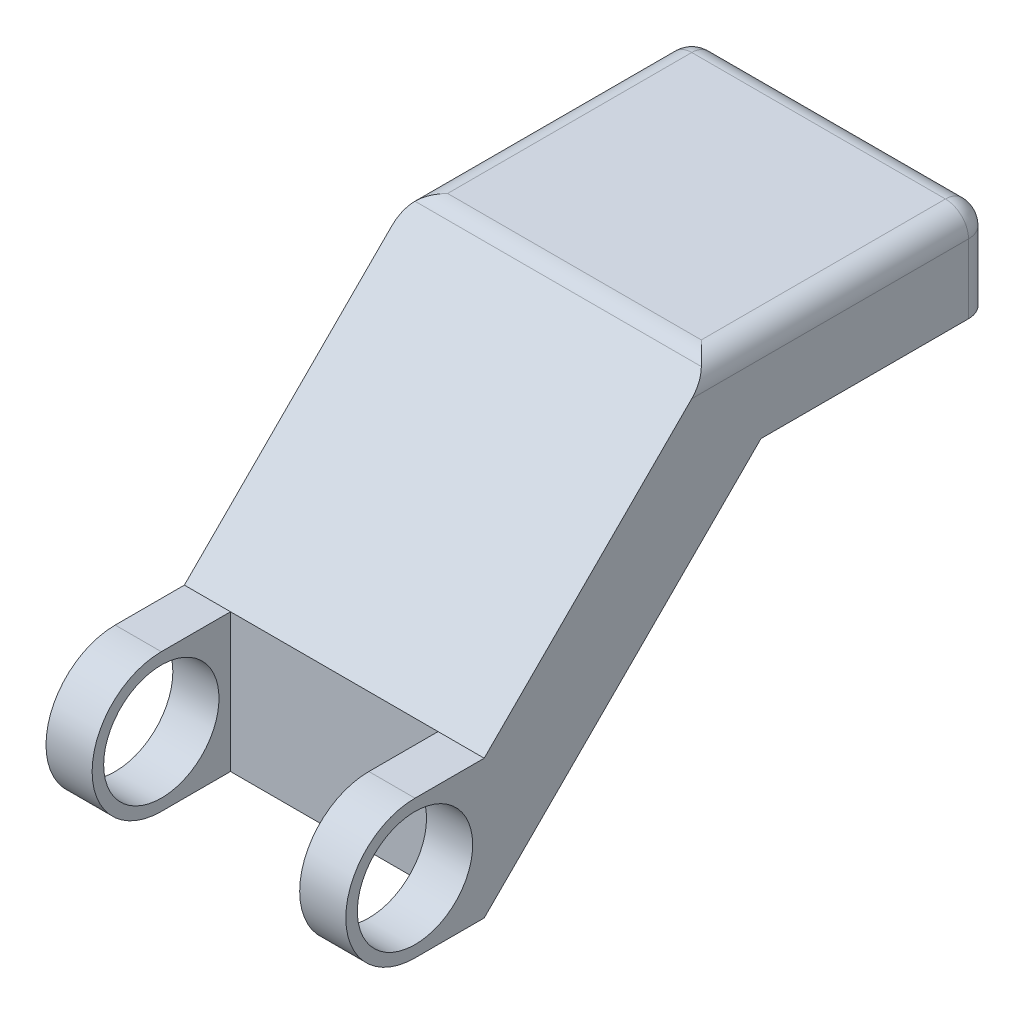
ISO-10303-21;
HEADER;
FILE_DESCRIPTION(('STEP AP214'),'2;1');
FILE_NAME('part.step','',(''),(''),'','','');
FILE_SCHEMA(('AUTOMOTIVE_DESIGN { 1 0 10303 214 1 1 1 1 }'));
ENDSEC;
DATA;
#1=APPLICATION_CONTEXT('core data for automotive mechanical design processes');
#2=APPLICATION_PROTOCOL_DEFINITION('international standard','automotive_design',2000,#1);
#3=PRODUCT_CONTEXT('',#1,'mechanical');
#4=PRODUCT('Part','Part','',(#3));
#5=PRODUCT_RELATED_PRODUCT_CATEGORY('part','',(#4));
#6=PRODUCT_DEFINITION_FORMATION('','',#4);
#7=PRODUCT_DEFINITION_CONTEXT('part definition',#1,'design');
#8=PRODUCT_DEFINITION('design','',#6,#7);
#9=PRODUCT_DEFINITION_SHAPE('','',#8);
#10=(LENGTH_UNIT() NAMED_UNIT(*) SI_UNIT(.MILLI.,.METRE.));
#11=(NAMED_UNIT(*) PLANE_ANGLE_UNIT() SI_UNIT($,.RADIAN.));
#12=(NAMED_UNIT(*) SI_UNIT($,.STERADIAN.) SOLID_ANGLE_UNIT());
#13=UNCERTAINTY_MEASURE_WITH_UNIT(LENGTH_MEASURE(1.E-05),#10,'distance_accuracy_value','');
#14=(GEOMETRIC_REPRESENTATION_CONTEXT(3) GLOBAL_UNCERTAINTY_ASSIGNED_CONTEXT((#13)) GLOBAL_UNIT_ASSIGNED_CONTEXT((#10,
#11,#12)) REPRESENTATION_CONTEXT('',''));
#15=CARTESIAN_POINT('',(0.,0.,0.));
#16=DIRECTION('',(0.,0.,1.));
#17=DIRECTION('',(1.,0.,0.));
#18=AXIS2_PLACEMENT_3D('',#15,#16,#17);
#19=CARTESIAN_POINT('',(65.,30.,15.));
#20=DIRECTION('',(0.,-1.,0.));
#21=DIRECTION('',(0.,0.,-1.));
#22=AXIS2_PLACEMENT_3D('',#19,#20,#21);
#23=PLANE('',#22);
#24=DIRECTION('',(-1.,0.,0.));
#25=VECTOR('',#24,1.);
#26=CARTESIAN_POINT('',(65.,30.,15.));
#27=LINE('',#26,#25);
#28=CARTESIAN_POINT('',(10.,30.,15.));
#29=VERTEX_POINT('',#28);
#30=CARTESIAN_POINT('',(0.,30.,15.));
#31=VERTEX_POINT('',#30);
#32=EDGE_CURVE('E244',#29,#31,#27,.T.);
#33=ORIENTED_EDGE('',*,*,#32,.F.);
#34=DIRECTION('',(0.,0.,-1.));
#35=VECTOR('',#34,1.);
#36=CARTESIAN_POINT('',(10.,30.,15.));
#37=LINE('',#36,#35);
#38=CARTESIAN_POINT('',(10.,30.,0.));
#39=VERTEX_POINT('',#38);
#40=EDGE_CURVE('E204',#29,#39,#37,.T.);
#41=ORIENTED_EDGE('',*,*,#40,.T.);
#42=DIRECTION('',(-1.,0.,0.));
#43=VECTOR('',#42,1.);
#44=CARTESIAN_POINT('',(65.,30.,0.));
#45=LINE('',#44,#43);
#46=CARTESIAN_POINT('',(0.,30.,0.));
#47=VERTEX_POINT('',#46);
#48=EDGE_CURVE('E248',#39,#47,#45,.T.);
#49=ORIENTED_EDGE('',*,*,#48,.T.);
#50=DIRECTION('',(0.,0.,1.));
#51=VECTOR('',#50,1.);
#52=CARTESIAN_POINT('',(0.,30.,15.));
#53=LINE('',#52,#51);
#54=EDGE_CURVE('E233',#47,#31,#53,.T.);
#55=ORIENTED_EDGE('',*,*,#54,.T.);
#56=EDGE_LOOP('',(#33,#41,#49,#55));
#57=FACE_BOUND('',#56,.T.);
#58=ADVANCED_FACE('F33',(#57),#23,.F.);
#59=CARTESIAN_POINT('',(65.,15.,15.));
#60=DIRECTION('',(-1.,0.,0.));
#61=DIRECTION('',(0.,0.,1.));
#62=AXIS2_PLACEMENT_3D('',#59,#60,#61);
#63=CYLINDRICAL_SURFACE('',#62,15.);
#64=DIRECTION('',(-1.,0.,0.));
#65=VECTOR('',#64,1.);
#66=CARTESIAN_POINT('',(65.,0.,15.));
#67=LINE('',#66,#65);
#68=CARTESIAN_POINT('',(10.,0.,15.));
#69=VERTEX_POINT('',#68);
#70=CARTESIAN_POINT('',(0.,0.,15.));
#71=VERTEX_POINT('',#70);
#72=EDGE_CURVE('E240',#69,#71,#67,.T.);
#73=ORIENTED_EDGE('',*,*,#72,.F.);
#74=CARTESIAN_POINT('',(10.,15.,15.));
#75=DIRECTION('',(-1.,0.,0.));
#76=DIRECTION('',(0.,0.,1.));
#77=AXIS2_PLACEMENT_3D('',#74,#75,#76);
#78=CIRCLE('',#77,15.);
#79=EDGE_CURVE('E172',#69,#29,#78,.T.);
#80=ORIENTED_EDGE('',*,*,#79,.T.);
#81=ORIENTED_EDGE('',*,*,#32,.T.);
#82=CARTESIAN_POINT('',(0.,15.,15.));
#83=DIRECTION('',(1.,0.,0.));
#84=DIRECTION('',(0.,0.,-1.));
#85=AXIS2_PLACEMENT_3D('',#82,#83,#84);
#86=CIRCLE('',#85,15.);
#87=EDGE_CURVE('E236',#31,#71,#86,.T.);
#88=ORIENTED_EDGE('',*,*,#87,.T.);
#89=EDGE_LOOP('',(#73,#80,#81,#88));
#90=FACE_BOUND('',#89,.T.);
#91=ADVANCED_FACE('F380',(#90),#63,.T.);
#92=CARTESIAN_POINT('',(65.,0.,0.));
#93=DIRECTION('',(0.,1.,0.));
#94=DIRECTION('',(0.,0.,1.));
#95=AXIS2_PLACEMENT_3D('',#92,#93,#94);
#96=PLANE('',#95);
#97=DIRECTION('',(-1.,0.,0.));
#98=VECTOR('',#97,1.);
#99=CARTESIAN_POINT('',(65.,0.,0.));
#100=LINE('',#99,#98);
#101=CARTESIAN_POINT('',(10.,0.,0.));
#102=VERTEX_POINT('',#101);
#103=CARTESIAN_POINT('',(0.,0.,0.));
#104=VERTEX_POINT('',#103);
#105=EDGE_CURVE('E178',#102,#104,#100,.T.);
#106=ORIENTED_EDGE('',*,*,#105,.F.);
#107=DIRECTION('',(0.,0.,1.));
#108=VECTOR('',#107,1.);
#109=CARTESIAN_POINT('',(10.,0.,0.));
#110=LINE('',#109,#108);
#111=EDGE_CURVE('E168',#102,#69,#110,.T.);
#112=ORIENTED_EDGE('',*,*,#111,.T.);
#113=ORIENTED_EDGE('',*,*,#72,.T.);
#114=DIRECTION('',(0.,0.,-1.));
#115=VECTOR('',#114,1.);
#116=CARTESIAN_POINT('',(0.,0.,0.));
#117=LINE('',#116,#115);
#118=EDGE_CURVE('E181',#71,#104,#117,.T.);
#119=ORIENTED_EDGE('',*,*,#118,.T.);
#120=EDGE_LOOP('',(#106,#112,#113,#119));
#121=FACE_BOUND('',#120,.T.);
#122=ADVANCED_FACE('F179',(#121),#96,.F.);
#123=CARTESIAN_POINT('',(65.,15.,15.));
#124=DIRECTION('',(-1.,0.,0.));
#125=DIRECTION('',(0.,0.,1.));
#126=AXIS2_PLACEMENT_3D('',#123,#124,#125);
#127=CYLINDRICAL_SURFACE('',#126,12.5);
#128=CARTESIAN_POINT('',(10.,15.,15.));
#129=DIRECTION('',(-1.,0.,0.));
#130=DIRECTION('',(0.,0.,1.));
#131=AXIS2_PLACEMENT_3D('',#128,#129,#130);
#132=CIRCLE('',#131,12.5);
#133=CARTESIAN_POINT('',(10.,15.,27.5));
#134=VERTEX_POINT('',#133);
#135=EDGE_CURVE('E202',#134,#134,#132,.T.);
#136=ORIENTED_EDGE('',*,*,#135,.F.);
#137=EDGE_LOOP('',(#136));
#138=FACE_BOUND('',#137,.T.);
#139=CARTESIAN_POINT('',(0.,15.,15.));
#140=DIRECTION('',(1.,0.,0.));
#141=DIRECTION('',(0.,0.,-1.));
#142=AXIS2_PLACEMENT_3D('',#139,#140,#141);
#143=CIRCLE('',#142,12.5);
#144=CARTESIAN_POINT('',(0.,15.,2.5));
#145=VERTEX_POINT('',#144);
#146=EDGE_CURVE('E207',#145,#145,#143,.T.);
#147=ORIENTED_EDGE('',*,*,#146,.F.);
#148=EDGE_LOOP('',(#147));
#149=FACE_BOUND('',#148,.T.);
#150=ADVANCED_FACE('F499',(#138,#149),#127,.F.);
#151=CARTESIAN_POINT('',(65.,15.,15.));
#152=DIRECTION('',(1.,0.,0.));
#153=DIRECTION('',(0.,0.,-1.));
#154=AXIS2_PLACEMENT_3D('',#151,#152,#153);
#155=PLANE('',#154);
#156=DIRECTION('',(0.,0.,-1.));
#157=VECTOR('',#156,1.);
#158=CARTESIAN_POINT('',(65.,60.,-110.));
#159=LINE('',#158,#157);
#160=CARTESIAN_POINT('',(65.,60.,-59.9999999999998));
#161=VERTEX_POINT('',#160);
#162=CARTESIAN_POINT('',(65.,60.,-105.));
#163=VERTEX_POINT('',#162);
#164=EDGE_CURVE('E217',#161,#163,#159,.T.);
#165=ORIENTED_EDGE('',*,*,#164,.T.);
#166=DIRECTION('',(0.,1.,0.));
#167=VECTOR('',#166,1.);
#168=CARTESIAN_POINT('',(65.,80.,-105.));
#169=LINE('',#168,#167);
#170=CARTESIAN_POINT('',(65.,75.,-105.));
#171=VERTEX_POINT('',#170);
#172=EDGE_CURVE('E264',#163,#171,#169,.T.);
#173=ORIENTED_EDGE('',*,*,#172,.T.);
#174=DIRECTION('',(0.,0.,1.));
#175=VECTOR('',#174,1.);
#176=CARTESIAN_POINT('',(65.,75.,-49.9999999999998));
#177=LINE('',#176,#175);
#178=CARTESIAN_POINT('',(65.,75.,-44.9999999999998));
#179=VERTEX_POINT('',#178);
#180=EDGE_CURVE('E258',#171,#179,#177,.T.);
#181=ORIENTED_EDGE('',*,*,#180,.T.);
#182=DIRECTION('',(0.,-0.707106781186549,0.707106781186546));
#183=VECTOR('',#182,1.);
#184=CARTESIAN_POINT('',(65.,30.,0.));
#185=LINE('',#184,#183);
#186=CARTESIAN_POINT('',(65.,30.,0.));
#187=VERTEX_POINT('',#186);
#188=EDGE_CURVE('E220',#179,#187,#185,.T.);
#189=ORIENTED_EDGE('',*,*,#188,.T.);
#190=DIRECTION('',(0.,0.,1.));
#191=VECTOR('',#190,1.);
#192=CARTESIAN_POINT('',(65.,30.,15.));
#193=LINE('',#192,#191);
#194=CARTESIAN_POINT('',(65.,30.,15.));
#195=VERTEX_POINT('',#194);
#196=EDGE_CURVE('E222',#187,#195,#193,.T.);
#197=ORIENTED_EDGE('',*,*,#196,.T.);
#198=CARTESIAN_POINT('',(65.,15.,15.));
#199=DIRECTION('',(1.,0.,0.));
#200=DIRECTION('',(0.,0.,-1.));
#201=AXIS2_PLACEMENT_3D('',#198,#199,#200);
#202=CIRCLE('',#201,15.);
#203=CARTESIAN_POINT('',(65.,0.,15.));
#204=VERTEX_POINT('',#203);
#205=EDGE_CURVE('E224',#195,#204,#202,.T.);
#206=ORIENTED_EDGE('',*,*,#205,.T.);
#207=DIRECTION('',(0.,0.,-1.));
#208=VECTOR('',#207,1.);
#209=CARTESIAN_POINT('',(65.,0.,0.));
#210=LINE('',#209,#208);
#211=CARTESIAN_POINT('',(65.,0.,0.));
#212=VERTEX_POINT('',#211);
#213=EDGE_CURVE('E186',#204,#212,#210,.T.);
#214=ORIENTED_EDGE('',*,*,#213,.T.);
#215=DIRECTION('',(0.,0.707106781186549,-0.707106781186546));
#216=VECTOR('',#215,1.);
#217=CARTESIAN_POINT('',(65.,60.,-59.9999999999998));
#218=LINE('',#217,#216);
#219=EDGE_CURVE('E214',#212,#161,#218,.T.);
#220=ORIENTED_EDGE('',*,*,#219,.T.);
#221=EDGE_LOOP('',(#165,#173,#181,#189,#197,#206,#214,#220));
#222=FACE_BOUND('',#221,.T.);
#223=CARTESIAN_POINT('',(65.,15.,15.));
#224=DIRECTION('',(1.,0.,0.));
#225=DIRECTION('',(0.,0.,-1.));
#226=AXIS2_PLACEMENT_3D('',#223,#224,#225);
#227=CIRCLE('',#226,12.5);
#228=CARTESIAN_POINT('',(65.,15.,2.5));
#229=VERTEX_POINT('',#228);
#230=EDGE_CURVE('E208',#229,#229,#227,.T.);
#231=ORIENTED_EDGE('',*,*,#230,.F.);
#232=EDGE_LOOP('',(#231));
#233=FACE_BOUND('',#232,.T.);
#234=ADVANCED_FACE('F340',(#222,#233),#155,.T.);
#235=CARTESIAN_POINT('',(0.,15.,15.));
#236=DIRECTION('',(1.,0.,0.));
#237=DIRECTION('',(0.,0.,-1.));
#238=AXIS2_PLACEMENT_3D('',#235,#236,#237);
#239=PLANE('',#238);
#240=DIRECTION('',(0.,0.,1.));
#241=VECTOR('',#240,1.);
#242=CARTESIAN_POINT('',(0.,75.,15.));
#243=LINE('',#242,#241);
#244=CARTESIAN_POINT('',(0.,75.,-44.9999999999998));
#245=VERTEX_POINT('',#244);
#246=CARTESIAN_POINT('',(0.,75.,-105.));
#247=VERTEX_POINT('',#246);
#248=EDGE_CURVE('E277',#245,#247,#243,.F.);
#249=ORIENTED_EDGE('',*,*,#248,.T.);
#250=DIRECTION('',(0.,1.,0.));
#251=VECTOR('',#250,1.);
#252=CARTESIAN_POINT('',(0.,15.,-105.));
#253=LINE('',#252,#251);
#254=CARTESIAN_POINT('',(0.,60.,-105.));
#255=VERTEX_POINT('',#254);
#256=EDGE_CURVE('E279',#247,#255,#253,.F.);
#257=ORIENTED_EDGE('',*,*,#256,.T.);
#258=DIRECTION('',(0.,0.,-1.));
#259=VECTOR('',#258,1.);
#260=CARTESIAN_POINT('',(0.,60.,-110.));
#261=LINE('',#260,#259);
#262=CARTESIAN_POINT('',(0.,60.,-59.9999999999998));
#263=VERTEX_POINT('',#262);
#264=EDGE_CURVE('E228',#263,#255,#261,.T.);
#265=ORIENTED_EDGE('',*,*,#264,.F.);
#266=DIRECTION('',(0.,0.707106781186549,-0.707106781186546));
#267=VECTOR('',#266,1.);
#268=CARTESIAN_POINT('',(0.,60.,-59.9999999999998));
#269=LINE('',#268,#267);
#270=EDGE_CURVE('E211',#104,#263,#269,.T.);
#271=ORIENTED_EDGE('',*,*,#270,.F.);
#272=ORIENTED_EDGE('',*,*,#118,.F.);
#273=ORIENTED_EDGE('',*,*,#87,.F.);
#274=ORIENTED_EDGE('',*,*,#54,.F.);
#275=DIRECTION('',(0.,-0.707106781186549,0.707106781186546));
#276=VECTOR('',#275,1.);
#277=CARTESIAN_POINT('',(0.,30.,0.));
#278=LINE('',#277,#276);
#279=EDGE_CURVE('E231',#245,#47,#278,.T.);
#280=ORIENTED_EDGE('',*,*,#279,.F.);
#281=EDGE_LOOP('',(#249,#257,#265,#271,#272,#273,#274,#280));
#282=FACE_BOUND('',#281,.T.);
#283=ORIENTED_EDGE('',*,*,#146,.T.);
#284=EDGE_LOOP('',(#283));
#285=FACE_BOUND('',#284,.T.);
#286=ADVANCED_FACE('F327',(#282,#285),#239,.F.);
#287=CARTESIAN_POINT('',(65.,60.,-59.9999999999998));
#288=DIRECTION('',(0.,0.707106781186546,0.707106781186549));
#289=DIRECTION('',(0.,-0.707106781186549,0.707106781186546));
#290=AXIS2_PLACEMENT_3D('',#287,#288,#289);
#291=PLANE('',#290);
#292=ORIENTED_EDGE('',*,*,#270,.T.);
#293=DIRECTION('',(-1.,0.,0.));
#294=VECTOR('',#293,1.);
#295=CARTESIAN_POINT('',(65.,60.,-59.9999999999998));
#296=LINE('',#295,#294);
#297=EDGE_CURVE('E255',#161,#263,#296,.T.);
#298=ORIENTED_EDGE('',*,*,#297,.F.);
#299=ORIENTED_EDGE('',*,*,#219,.F.);
#300=CARTESIAN_POINT('',(55.,0.,0.));
#301=VERTEX_POINT('',#300);
#302=EDGE_CURVE('E185',#212,#301,#100,.T.);
#303=ORIENTED_EDGE('',*,*,#302,.T.);
#304=DIRECTION('',(-1.,0.,0.));
#305=VECTOR('',#304,1.);
#306=CARTESIAN_POINT('',(10.,0.,0.));
#307=LINE('',#306,#305);
#308=EDGE_CURVE('E158',#301,#102,#307,.T.);
#309=ORIENTED_EDGE('',*,*,#308,.T.);
#310=ORIENTED_EDGE('',*,*,#105,.T.);
#311=EDGE_LOOP('',(#292,#298,#299,#303,#309,#310));
#312=FACE_BOUND('',#311,.T.);
#313=ADVANCED_FACE('F189',(#312),#291,.F.);
#314=CARTESIAN_POINT('',(65.,60.,-110.));
#315=DIRECTION('',(0.,1.,0.));
#316=DIRECTION('',(0.,0.,1.));
#317=AXIS2_PLACEMENT_3D('',#314,#315,#316);
#318=PLANE('',#317);
#319=DIRECTION('',(-1.,0.,0.));
#320=VECTOR('',#319,1.);
#321=CARTESIAN_POINT('',(65.,60.,-110.));
#322=LINE('',#321,#320);
#323=CARTESIAN_POINT('',(60.,60.,-110.));
#324=VERTEX_POINT('',#323);
#325=CARTESIAN_POINT('',(5.,60.,-110.));
#326=VERTEX_POINT('',#325);
#327=EDGE_CURVE('E252',#324,#326,#322,.T.);
#328=ORIENTED_EDGE('',*,*,#327,.F.);
#329=CARTESIAN_POINT('',(60.,60.,-105.));
#330=DIRECTION('',(0.,1.,0.));
#331=DIRECTION('',(0.,0.,1.));
#332=AXIS2_PLACEMENT_3D('',#329,#330,#331);
#333=CIRCLE('',#332,5.);
#334=EDGE_CURVE('E275',#324,#163,#333,.F.);
#335=ORIENTED_EDGE('',*,*,#334,.T.);
#336=ORIENTED_EDGE('',*,*,#164,.F.);
#337=ORIENTED_EDGE('',*,*,#297,.T.);
#338=ORIENTED_EDGE('',*,*,#264,.T.);
#339=CARTESIAN_POINT('',(5.,60.,-105.));
#340=DIRECTION('',(0.,1.,0.));
#341=DIRECTION('',(0.,0.,1.));
#342=AXIS2_PLACEMENT_3D('',#339,#340,#341);
#343=CIRCLE('',#342,5.);
#344=EDGE_CURVE('E273',#255,#326,#343,.F.);
#345=ORIENTED_EDGE('',*,*,#344,.T.);
#346=EDGE_LOOP('',(#328,#335,#336,#337,#338,#345));
#347=FACE_BOUND('',#346,.T.);
#348=ADVANCED_FACE('F365',(#347),#318,.F.);
#349=CARTESIAN_POINT('',(65.,80.,-110.));
#350=DIRECTION('',(0.,0.,1.));
#351=DIRECTION('',(1.,0.,0.));
#352=AXIS2_PLACEMENT_3D('',#349,#350,#351);
#353=PLANE('',#352);
#354=DIRECTION('',(-1.,0.,0.));
#355=VECTOR('',#354,1.);
#356=CARTESIAN_POINT('',(65.,75.,-110.));
#357=LINE('',#356,#355);
#358=CARTESIAN_POINT('',(5.,75.,-110.));
#359=VERTEX_POINT('',#358);
#360=CARTESIAN_POINT('',(60.,75.,-110.));
#361=VERTEX_POINT('',#360);
#362=EDGE_CURVE('E267',#359,#361,#357,.F.);
#363=ORIENTED_EDGE('',*,*,#362,.T.);
#364=DIRECTION('',(0.,1.,0.));
#365=VECTOR('',#364,1.);
#366=CARTESIAN_POINT('',(60.,60.,-110.));
#367=LINE('',#366,#365);
#368=EDGE_CURVE('E271',#361,#324,#367,.F.);
#369=ORIENTED_EDGE('',*,*,#368,.T.);
#370=ORIENTED_EDGE('',*,*,#327,.T.);
#371=DIRECTION('',(0.,1.,0.));
#372=VECTOR('',#371,1.);
#373=CARTESIAN_POINT('',(5.,80.,-110.));
#374=LINE('',#373,#372);
#375=EDGE_CURVE('E269',#326,#359,#374,.T.);
#376=ORIENTED_EDGE('',*,*,#375,.T.);
#377=EDGE_LOOP('',(#363,#369,#370,#376));
#378=FACE_BOUND('',#377,.T.);
#379=ADVANCED_FACE('F362',(#378),#353,.F.);
#380=CARTESIAN_POINT('',(65.,80.,-49.9999999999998));
#381=DIRECTION('',(0.,-1.,0.));
#382=DIRECTION('',(0.,0.,-1.));
#383=AXIS2_PLACEMENT_3D('',#380,#381,#382);
#384=PLANE('',#383);
#385=DIRECTION('',(0.,0.,1.));
#386=VECTOR('',#385,1.);
#387=CARTESIAN_POINT('',(5.,80.,-49.9999999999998));
#388=LINE('',#387,#386);
#389=CARTESIAN_POINT('',(5.,80.,-105.));
#390=VERTEX_POINT('',#389);
#391=CARTESIAN_POINT('',(5.,80.,-52.0710678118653));
#392=VERTEX_POINT('',#391);
#393=EDGE_CURVE('E56',#390,#392,#388,.T.);
#394=ORIENTED_EDGE('',*,*,#393,.T.);
#395=DIRECTION('',(-1.,0.,0.));
#396=VECTOR('',#395,1.);
#397=CARTESIAN_POINT('',(65.,80.,-52.0710678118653));
#398=LINE('',#397,#396);
#399=CARTESIAN_POINT('',(60.,80.,-52.0710678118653));
#400=VERTEX_POINT('',#399);
#401=EDGE_CURVE('E11',#392,#400,#398,.F.);
#402=ORIENTED_EDGE('',*,*,#401,.T.);
#403=DIRECTION('',(0.,0.,1.));
#404=VECTOR('',#403,1.);
#405=CARTESIAN_POINT('',(60.,80.,-110.));
#406=LINE('',#405,#404);
#407=CARTESIAN_POINT('',(60.,80.,-105.));
#408=VERTEX_POINT('',#407);
#409=EDGE_CURVE('E42',#400,#408,#406,.F.);
#410=ORIENTED_EDGE('',*,*,#409,.T.);
#411=DIRECTION('',(-1.,0.,0.));
#412=VECTOR('',#411,1.);
#413=CARTESIAN_POINT('',(65.,80.,-105.));
#414=LINE('',#413,#412);
#415=EDGE_CURVE('E287',#408,#390,#414,.T.);
#416=ORIENTED_EDGE('',*,*,#415,.T.);
#417=EDGE_LOOP('',(#394,#402,#410,#416));
#418=FACE_BOUND('',#417,.T.);
#419=ADVANCED_FACE('F346',(#418),#384,.F.);
#420=CARTESIAN_POINT('',(65.,30.,0.));
#421=DIRECTION('',(0.,-0.707106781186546,-0.707106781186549));
#422=DIRECTION('',(0.,0.707106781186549,-0.707106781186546));
#423=AXIS2_PLACEMENT_3D('',#420,#421,#422);
#424=PLANE('',#423);
#425=ORIENTED_EDGE('',*,*,#188,.F.);
#426=CARTESIAN_POINT('',(60.,75.,-44.9999999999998));
#427=DIRECTION('',(0.,-0.707106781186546,-0.707106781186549));
#428=DIRECTION('',(0.,0.707106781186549,-0.707106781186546));
#429=AXIS2_PLACEMENT_3D('',#426,#427,#428);
#430=ELLIPSE('',#429,7.07106781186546,5.);
#431=CARTESIAN_POINT('',(63.5355339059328,78.5355339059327,-48.5355339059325));
#432=VERTEX_POINT('',#431);
#433=EDGE_CURVE('E285',#179,#432,#430,.F.);
#434=ORIENTED_EDGE('',*,*,#433,.T.);
#435=DIRECTION('',(-1.,0.,0.));
#436=VECTOR('',#435,1.);
#437=CARTESIAN_POINT('',(65.,78.5355339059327,-48.5355339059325));
#438=LINE('',#437,#436);
#439=CARTESIAN_POINT('',(1.46446609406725,78.5355339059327,-48.5355339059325));
#440=VERTEX_POINT('',#439);
#441=EDGE_CURVE('E283',#432,#440,#438,.T.);
#442=ORIENTED_EDGE('',*,*,#441,.T.);
#443=CARTESIAN_POINT('',(5.,75.,-44.9999999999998));
#444=DIRECTION('',(0.,-0.707106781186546,-0.707106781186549));
#445=DIRECTION('',(0.,-0.707106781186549,0.707106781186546));
#446=AXIS2_PLACEMENT_3D('',#443,#444,#445);
#447=ELLIPSE('',#446,7.07106781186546,5.);
#448=EDGE_CURVE('E281',#440,#245,#447,.F.);
#449=ORIENTED_EDGE('',*,*,#448,.T.);
#450=ORIENTED_EDGE('',*,*,#279,.T.);
#451=ORIENTED_EDGE('',*,*,#48,.F.);
#452=DIRECTION('',(1.,0.,0.));
#453=VECTOR('',#452,1.);
#454=CARTESIAN_POINT('',(65.,30.,0.));
#455=LINE('',#454,#453);
#456=CARTESIAN_POINT('',(55.,30.,0.));
#457=VERTEX_POINT('',#456);
#458=EDGE_CURVE('E161',#39,#457,#455,.T.);
#459=ORIENTED_EDGE('',*,*,#458,.T.);
#460=EDGE_CURVE('E249',#187,#457,#45,.T.);
#461=ORIENTED_EDGE('',*,*,#460,.F.);
#462=EDGE_LOOP('',(#425,#434,#442,#449,#450,#451,#459,#461));
#463=FACE_BOUND('',#462,.T.);
#464=ADVANCED_FACE('F322',(#463),#424,.F.);
#465=ORIENTED_EDGE('',*,*,#460,.T.);
#466=DIRECTION('',(0.,0.,1.));
#467=VECTOR('',#466,1.);
#468=CARTESIAN_POINT('',(55.,30.,15.));
#469=LINE('',#468,#467);
#470=CARTESIAN_POINT('',(55.,30.,15.));
#471=VERTEX_POINT('',#470);
#472=EDGE_CURVE('E199',#457,#471,#469,.T.);
#473=ORIENTED_EDGE('',*,*,#472,.T.);
#474=EDGE_CURVE('E245',#195,#471,#27,.T.);
#475=ORIENTED_EDGE('',*,*,#474,.F.);
#476=ORIENTED_EDGE('',*,*,#196,.F.);
#477=EDGE_LOOP('',(#465,#473,#475,#476));
#478=FACE_BOUND('',#477,.T.);
#479=ADVANCED_FACE('F336',(#478),#23,.F.);
#480=ORIENTED_EDGE('',*,*,#474,.T.);
#481=CARTESIAN_POINT('',(55.,15.,15.));
#482=DIRECTION('',(1.,0.,0.));
#483=DIRECTION('',(0.,0.,-1.));
#484=AXIS2_PLACEMENT_3D('',#481,#482,#483);
#485=CIRCLE('',#484,15.);
#486=CARTESIAN_POINT('',(55.,0.,15.));
#487=VERTEX_POINT('',#486);
#488=EDGE_CURVE('E197',#471,#487,#485,.T.);
#489=ORIENTED_EDGE('',*,*,#488,.T.);
#490=EDGE_CURVE('E241',#204,#487,#67,.T.);
#491=ORIENTED_EDGE('',*,*,#490,.F.);
#492=ORIENTED_EDGE('',*,*,#205,.F.);
#493=EDGE_LOOP('',(#480,#489,#491,#492));
#494=FACE_BOUND('',#493,.T.);
#495=ADVANCED_FACE('F387',(#494),#63,.T.);
#496=ORIENTED_EDGE('',*,*,#490,.T.);
#497=DIRECTION('',(0.,0.,-1.));
#498=VECTOR('',#497,1.);
#499=CARTESIAN_POINT('',(55.,0.,0.));
#500=LINE('',#499,#498);
#501=EDGE_CURVE('E175',#487,#301,#500,.T.);
#502=ORIENTED_EDGE('',*,*,#501,.T.);
#503=ORIENTED_EDGE('',*,*,#302,.F.);
#504=ORIENTED_EDGE('',*,*,#213,.F.);
#505=EDGE_LOOP('',(#496,#502,#503,#504));
#506=FACE_BOUND('',#505,.T.);
#507=ADVANCED_FACE('F394',(#506),#96,.F.);
#508=CARTESIAN_POINT('',(55.,15.,15.));
#509=DIRECTION('',(1.,0.,0.));
#510=DIRECTION('',(0.,0.,-1.));
#511=AXIS2_PLACEMENT_3D('',#508,#509,#510);
#512=CIRCLE('',#511,12.5);
#513=CARTESIAN_POINT('',(55.,15.,2.5));
#514=VERTEX_POINT('',#513);
#515=EDGE_CURVE('E164',#514,#514,#512,.T.);
#516=ORIENTED_EDGE('',*,*,#515,.F.);
#517=EDGE_LOOP('',(#516));
#518=FACE_BOUND('',#517,.T.);
#519=ORIENTED_EDGE('',*,*,#230,.T.);
#520=EDGE_LOOP('',(#519));
#521=FACE_BOUND('',#520,.T.);
#522=ADVANCED_FACE('F481',(#518,#521),#127,.F.);
#523=CARTESIAN_POINT('',(10.,0.,0.));
#524=DIRECTION('',(0.,0.,-1.));
#525=DIRECTION('',(-1.,0.,0.));
#526=AXIS2_PLACEMENT_3D('',#523,#524,#525);
#527=PLANE('',#526);
#528=DIRECTION('',(0.,1.,0.));
#529=VECTOR('',#528,1.);
#530=CARTESIAN_POINT('',(10.,0.,0.));
#531=LINE('',#530,#529);
#532=EDGE_CURVE('E153',#102,#39,#531,.T.);
#533=ORIENTED_EDGE('',*,*,#532,.F.);
#534=ORIENTED_EDGE('',*,*,#308,.F.);
#535=DIRECTION('',(0.,1.,0.));
#536=VECTOR('',#535,1.);
#537=CARTESIAN_POINT('',(55.,0.,0.));
#538=LINE('',#537,#536);
#539=EDGE_CURVE('E165',#301,#457,#538,.T.);
#540=ORIENTED_EDGE('',*,*,#539,.T.);
#541=ORIENTED_EDGE('',*,*,#458,.F.);
#542=EDGE_LOOP('',(#533,#534,#540,#541));
#543=FACE_BOUND('',#542,.T.);
#544=ADVANCED_FACE('F155',(#543),#527,.F.);
#545=CARTESIAN_POINT('',(10.,0.,0.));
#546=DIRECTION('',(-1.,0.,0.));
#547=DIRECTION('',(0.,0.,1.));
#548=AXIS2_PLACEMENT_3D('',#545,#546,#547);
#549=PLANE('',#548);
#550=ORIENTED_EDGE('',*,*,#135,.T.);
#551=EDGE_LOOP('',(#550));
#552=FACE_BOUND('',#551,.T.);
#553=ORIENTED_EDGE('',*,*,#79,.F.);
#554=ORIENTED_EDGE('',*,*,#111,.F.);
#555=ORIENTED_EDGE('',*,*,#532,.T.);
#556=ORIENTED_EDGE('',*,*,#40,.F.);
#557=EDGE_LOOP('',(#553,#554,#555,#556));
#558=FACE_BOUND('',#557,.T.);
#559=ADVANCED_FACE('F170',(#552,#558),#549,.F.);
#560=CARTESIAN_POINT('',(55.,0.,0.));
#561=DIRECTION('',(1.,0.,0.));
#562=DIRECTION('',(0.,0.,-1.));
#563=AXIS2_PLACEMENT_3D('',#560,#561,#562);
#564=PLANE('',#563);
#565=ORIENTED_EDGE('',*,*,#515,.T.);
#566=EDGE_LOOP('',(#565));
#567=FACE_BOUND('',#566,.T.);
#568=ORIENTED_EDGE('',*,*,#539,.F.);
#569=ORIENTED_EDGE('',*,*,#501,.F.);
#570=ORIENTED_EDGE('',*,*,#488,.F.);
#571=ORIENTED_EDGE('',*,*,#472,.F.);
#572=EDGE_LOOP('',(#568,#569,#570,#571));
#573=FACE_BOUND('',#572,.T.);
#574=ADVANCED_FACE('F457',(#567,#573),#564,.F.);
#575=CARTESIAN_POINT('',(5.,75.,-49.9999999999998));
#576=DIRECTION('',(0.,0.,1.));
#577=DIRECTION('',(1.,0.,0.));
#578=AXIS2_PLACEMENT_3D('',#575,#576,#577);
#579=CYLINDRICAL_SURFACE('',#578,5.);
#580=ORIENTED_EDGE('',*,*,#248,.F.);
#581=ORIENTED_EDGE('',*,*,#448,.F.);
#582=CARTESIAN_POINT('',(5.,75.,-52.0710678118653));
#583=DIRECTION('',(0.707106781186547,0.,0.707106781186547));
#584=DIRECTION('',(-0.707106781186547,0.,0.707106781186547));
#585=AXIS2_PLACEMENT_3D('',#582,#583,#584);
#586=ELLIPSE('',#585,7.07106781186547,5.);
#587=EDGE_CURVE('E37',#392,#440,#586,.T.);
#588=ORIENTED_EDGE('',*,*,#587,.F.);
#589=ORIENTED_EDGE('',*,*,#393,.F.);
#590=CARTESIAN_POINT('',(5.,75.,-105.));
#591=DIRECTION('',(0.,0.,-1.));
#592=DIRECTION('',(-1.,0.,0.));
#593=AXIS2_PLACEMENT_3D('',#590,#591,#592);
#594=CIRCLE('',#593,5.);
#595=EDGE_CURVE('E306',#247,#390,#594,.T.);
#596=ORIENTED_EDGE('',*,*,#595,.F.);
#597=EDGE_LOOP('',(#580,#581,#588,#589,#596));
#598=FACE_BOUND('',#597,.T.);
#599=ADVANCED_FACE('F35',(#598),#579,.T.);
#600=CARTESIAN_POINT('',(5.,80.,-105.));
#601=DIRECTION('',(0.,1.,0.));
#602=DIRECTION('',(0.,0.,1.));
#603=AXIS2_PLACEMENT_3D('',#600,#601,#602);
#604=CYLINDRICAL_SURFACE('',#603,5.);
#605=ORIENTED_EDGE('',*,*,#344,.F.);
#606=ORIENTED_EDGE('',*,*,#256,.F.);
#607=CARTESIAN_POINT('',(5.,75.,-105.));
#608=DIRECTION('',(0.,1.,0.));
#609=DIRECTION('',(0.,0.,1.));
#610=AXIS2_PLACEMENT_3D('',#607,#608,#609);
#611=CIRCLE('',#610,5.);
#612=EDGE_CURVE('E304',#359,#247,#611,.T.);
#613=ORIENTED_EDGE('',*,*,#612,.F.);
#614=ORIENTED_EDGE('',*,*,#375,.F.);
#615=EDGE_LOOP('',(#605,#606,#613,#614));
#616=FACE_BOUND('',#615,.T.);
#617=ADVANCED_FACE('F368',(#616),#604,.T.);
#618=CARTESIAN_POINT('',(65.,75.,-52.0710678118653));
#619=DIRECTION('',(-1.,0.,0.));
#620=DIRECTION('',(0.,0.,1.));
#621=AXIS2_PLACEMENT_3D('',#618,#619,#620);
#622=CYLINDRICAL_SURFACE('',#621,5.);
#623=ORIENTED_EDGE('',*,*,#587,.T.);
#624=ORIENTED_EDGE('',*,*,#441,.F.);
#625=CARTESIAN_POINT('',(60.,75.,-52.0710678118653));
#626=DIRECTION('',(0.707106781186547,0.,-0.707106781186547));
#627=DIRECTION('',(-0.707106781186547,0.,-0.707106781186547));
#628=AXIS2_PLACEMENT_3D('',#625,#626,#627);
#629=ELLIPSE('',#628,7.07106781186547,5.);
#630=EDGE_CURVE('E302',#400,#432,#629,.T.);
#631=ORIENTED_EDGE('',*,*,#630,.F.);
#632=ORIENTED_EDGE('',*,*,#401,.F.);
#633=EDGE_LOOP('',(#623,#624,#631,#632));
#634=FACE_BOUND('',#633,.T.);
#635=ADVANCED_FACE('F315',(#634),#622,.T.);
#636=CARTESIAN_POINT('',(5.,75.,-105.));
#637=DIRECTION('',(-1.,0.,0.));
#638=DIRECTION('',(0.,0.,1.));
#639=AXIS2_PLACEMENT_3D('',#636,#637,#638);
#640=SPHERICAL_SURFACE('',#639,5.);
#641=ORIENTED_EDGE('',*,*,#612,.T.);
#642=ORIENTED_EDGE('',*,*,#595,.T.);
#643=CARTESIAN_POINT('',(5.,75.,-105.));
#644=DIRECTION('',(-1.,0.,0.));
#645=DIRECTION('',(0.,0.,1.));
#646=AXIS2_PLACEMENT_3D('',#643,#644,#645);
#647=CIRCLE('',#646,5.);
#648=EDGE_CURVE('E299',#359,#390,#647,.F.);
#649=ORIENTED_EDGE('',*,*,#648,.F.);
#650=EDGE_LOOP('',(#641,#642,#649));
#651=FACE_BOUND('',#650,.T.);
#652=ADVANCED_FACE('F370',(#651),#640,.T.);
#653=CARTESIAN_POINT('',(60.,75.,15.));
#654=DIRECTION('',(0.,0.,-1.));
#655=DIRECTION('',(-1.,0.,0.));
#656=AXIS2_PLACEMENT_3D('',#653,#654,#655);
#657=CYLINDRICAL_SURFACE('',#656,5.);
#658=ORIENTED_EDGE('',*,*,#433,.F.);
#659=ORIENTED_EDGE('',*,*,#180,.F.);
#660=CARTESIAN_POINT('',(60.,75.,-105.));
#661=DIRECTION('',(0.,0.,-1.));
#662=DIRECTION('',(-1.,0.,0.));
#663=AXIS2_PLACEMENT_3D('',#660,#661,#662);
#664=CIRCLE('',#663,5.);
#665=EDGE_CURVE('E296',#408,#171,#664,.T.);
#666=ORIENTED_EDGE('',*,*,#665,.F.);
#667=ORIENTED_EDGE('',*,*,#409,.F.);
#668=ORIENTED_EDGE('',*,*,#630,.T.);
#669=EDGE_LOOP('',(#658,#659,#666,#667,#668));
#670=FACE_BOUND('',#669,.T.);
#671=ADVANCED_FACE('F345',(#670),#657,.T.);
#672=CARTESIAN_POINT('',(65.,75.,-105.));
#673=DIRECTION('',(-1.,0.,0.));
#674=DIRECTION('',(0.,0.,1.));
#675=AXIS2_PLACEMENT_3D('',#672,#673,#674);
#676=CYLINDRICAL_SURFACE('',#675,5.);
#677=ORIENTED_EDGE('',*,*,#648,.T.);
#678=ORIENTED_EDGE('',*,*,#415,.F.);
#679=CARTESIAN_POINT('',(60.,75.,-105.));
#680=DIRECTION('',(1.,0.,0.));
#681=DIRECTION('',(0.,0.,-1.));
#682=AXIS2_PLACEMENT_3D('',#679,#680,#681);
#683=CIRCLE('',#682,5.);
#684=EDGE_CURVE('E293',#361,#408,#683,.T.);
#685=ORIENTED_EDGE('',*,*,#684,.F.);
#686=ORIENTED_EDGE('',*,*,#362,.F.);
#687=EDGE_LOOP('',(#677,#678,#685,#686));
#688=FACE_BOUND('',#687,.T.);
#689=ADVANCED_FACE('F350',(#688),#676,.T.);
#690=CARTESIAN_POINT('',(60.,75.,-105.));
#691=DIRECTION('',(0.,1.,0.));
#692=DIRECTION('',(0.,0.,1.));
#693=AXIS2_PLACEMENT_3D('',#690,#691,#692);
#694=SPHERICAL_SURFACE('',#693,5.);
#695=ORIENTED_EDGE('',*,*,#684,.T.);
#696=ORIENTED_EDGE('',*,*,#665,.T.);
#697=CARTESIAN_POINT('',(60.,75.,-105.));
#698=DIRECTION('',(0.,1.,0.));
#699=DIRECTION('',(0.,0.,1.));
#700=AXIS2_PLACEMENT_3D('',#697,#698,#699);
#701=CIRCLE('',#700,5.);
#702=EDGE_CURVE('E291',#361,#171,#701,.F.);
#703=ORIENTED_EDGE('',*,*,#702,.F.);
#704=EDGE_LOOP('',(#695,#696,#703));
#705=FACE_BOUND('',#704,.T.);
#706=ADVANCED_FACE('F355',(#705),#694,.T.);
#707=CARTESIAN_POINT('',(60.,15.,-105.));
#708=DIRECTION('',(0.,-1.,0.));
#709=DIRECTION('',(0.,0.,-1.));
#710=AXIS2_PLACEMENT_3D('',#707,#708,#709);
#711=CYLINDRICAL_SURFACE('',#710,5.);
#712=ORIENTED_EDGE('',*,*,#334,.F.);
#713=ORIENTED_EDGE('',*,*,#368,.F.);
#714=ORIENTED_EDGE('',*,*,#702,.T.);
#715=ORIENTED_EDGE('',*,*,#172,.F.);
#716=EDGE_LOOP('',(#712,#713,#714,#715));
#717=FACE_BOUND('',#716,.T.);
#718=ADVANCED_FACE('F359',(#717),#711,.T.);
#719=CLOSED_SHELL('',(#58,#91,#122,#150,#234,#286,#313,#348,#379,#419,#464,#479,#495,#507,#522,
#544,#559,#574,#599,#617,#635,#652,#671,#689,#706,#718));
#720=MANIFOLD_SOLID_BREP('B2',#719);
#721=ADVANCED_BREP_SHAPE_REPRESENTATION('',(#18,#720),#14);
#722=SHAPE_DEFINITION_REPRESENTATION(#9,#721);
ENDSEC;
END-ISO-10303-21;
